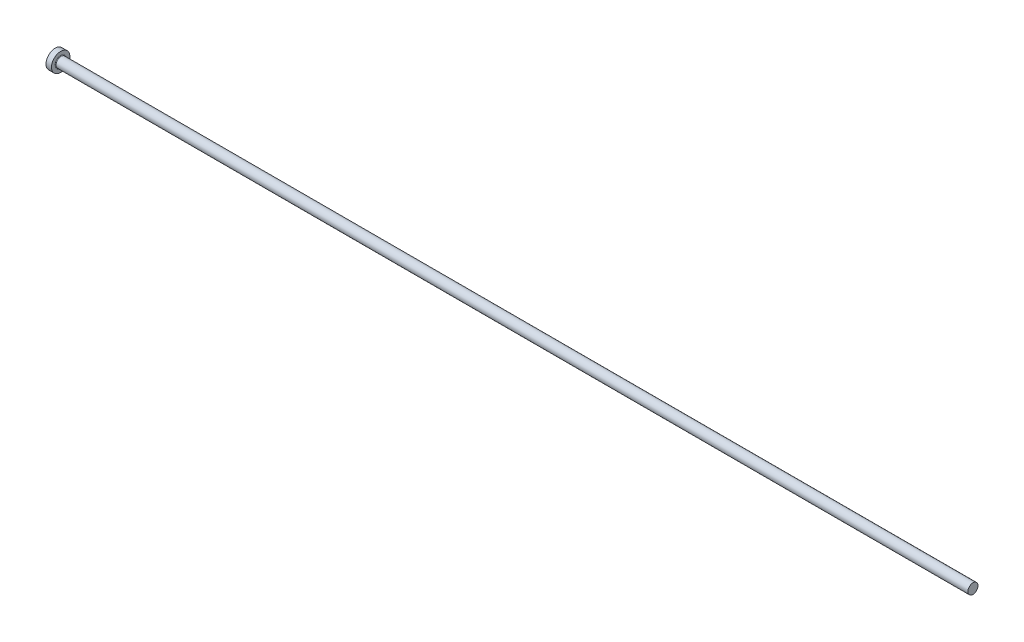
ISO-10303-21;
HEADER;
FILE_DESCRIPTION(('STEP AP214'),'2;1');
FILE_NAME('part.step','',(''),(''),'','','');
FILE_SCHEMA(('AUTOMOTIVE_DESIGN { 1 0 10303 214 1 1 1 1 }'));
ENDSEC;
DATA;
#1=APPLICATION_CONTEXT('core data for automotive mechanical design processes');
#2=APPLICATION_PROTOCOL_DEFINITION('international standard','automotive_design',2000,#1);
#3=PRODUCT_CONTEXT('',#1,'mechanical');
#4=PRODUCT('Part','Part','',(#3));
#5=PRODUCT_RELATED_PRODUCT_CATEGORY('part','',(#4));
#6=PRODUCT_DEFINITION_FORMATION('','',#4);
#7=PRODUCT_DEFINITION_CONTEXT('part definition',#1,'design');
#8=PRODUCT_DEFINITION('design','',#6,#7);
#9=PRODUCT_DEFINITION_SHAPE('','',#8);
#10=(LENGTH_UNIT() NAMED_UNIT(*) SI_UNIT(.MILLI.,.METRE.));
#11=(NAMED_UNIT(*) PLANE_ANGLE_UNIT() SI_UNIT($,.RADIAN.));
#12=(NAMED_UNIT(*) SI_UNIT($,.STERADIAN.) SOLID_ANGLE_UNIT());
#13=UNCERTAINTY_MEASURE_WITH_UNIT(LENGTH_MEASURE(1.E-05),#10,'distance_accuracy_value','');
#14=(GEOMETRIC_REPRESENTATION_CONTEXT(3) GLOBAL_UNCERTAINTY_ASSIGNED_CONTEXT((#13)) GLOBAL_UNIT_ASSIGNED_CONTEXT((#10,
#11,#12)) REPRESENTATION_CONTEXT('',''));
#15=CARTESIAN_POINT('',(0.,0.,0.));
#16=DIRECTION('',(0.,0.,1.));
#17=DIRECTION('',(1.,0.,0.));
#18=AXIS2_PLACEMENT_3D('',#15,#16,#17);
#19=CARTESIAN_POINT('',(0.,0.,0.));
#20=DIRECTION('',(-1.,0.,0.));
#21=DIRECTION('',(0.,-1.,0.));
#22=AXIS2_PLACEMENT_3D('',#19,#20,#21);
#23=PLANE('',#22);
#24=CARTESIAN_POINT('',(0.,0.,0.));
#25=DIRECTION('',(1.,0.,0.));
#26=DIRECTION('',(0.,1.,0.));
#27=AXIS2_PLACEMENT_3D('',#24,#25,#26);
#28=CIRCLE('',#27,5.);
#29=CARTESIAN_POINT('',(0.,5.,0.));
#30=VERTEX_POINT('',#29);
#31=EDGE_CURVE('E25',#30,#30,#28,.T.);
#32=ORIENTED_EDGE('',*,*,#31,.F.);
#33=EDGE_LOOP('',(#32));
#34=FACE_BOUND('',#33,.T.);
#35=ADVANCED_FACE('F14',(#34),#23,.T.);
#36=CARTESIAN_POINT('',(500.,0.,0.));
#37=DIRECTION('',(1.,0.,0.));
#38=DIRECTION('',(0.,1.,0.));
#39=AXIS2_PLACEMENT_3D('',#36,#37,#38);
#40=CYLINDRICAL_SURFACE('',#39,5.);
#41=ORIENTED_EDGE('',*,*,#31,.T.);
#42=EDGE_LOOP('',(#41));
#43=FACE_BOUND('',#42,.T.);
#44=CARTESIAN_POINT('',(3.,0.,0.));
#45=DIRECTION('',(1.,0.,0.));
#46=DIRECTION('',(0.,1.,0.));
#47=AXIS2_PLACEMENT_3D('',#44,#45,#46);
#48=CIRCLE('',#47,5.);
#49=CARTESIAN_POINT('',(3.,5.,0.));
#50=VERTEX_POINT('',#49);
#51=EDGE_CURVE('E29',#50,#50,#48,.T.);
#52=ORIENTED_EDGE('',*,*,#51,.F.);
#53=EDGE_LOOP('',(#52));
#54=FACE_BOUND('',#53,.T.);
#55=ADVANCED_FACE('F51',(#43,#54),#40,.T.);
#56=CARTESIAN_POINT('',(3.,5.,0.));
#57=DIRECTION('',(1.,0.,0.));
#58=DIRECTION('',(0.,1.,0.));
#59=AXIS2_PLACEMENT_3D('',#56,#57,#58);
#60=PLANE('',#59);
#61=CARTESIAN_POINT('',(3.,0.,0.));
#62=DIRECTION('',(1.,0.,0.));
#63=DIRECTION('',(0.,1.,0.));
#64=AXIS2_PLACEMENT_3D('',#61,#62,#63);
#65=CIRCLE('',#64,3.04999999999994);
#66=CARTESIAN_POINT('',(3.,3.04999999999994,0.));
#67=VERTEX_POINT('',#66);
#68=EDGE_CURVE('E9',#67,#67,#65,.F.);
#69=ORIENTED_EDGE('',*,*,#68,.T.);
#70=EDGE_LOOP('',(#69));
#71=FACE_BOUND('',#70,.T.);
#72=ORIENTED_EDGE('',*,*,#51,.T.);
#73=EDGE_LOOP('',(#72));
#74=FACE_BOUND('',#73,.T.);
#75=ADVANCED_FACE('F42',(#71,#74),#60,.T.);
#76=CARTESIAN_POINT('',(500.,0.,0.));
#77=DIRECTION('',(1.,0.,0.));
#78=DIRECTION('',(0.,1.,0.));
#79=AXIS2_PLACEMENT_3D('',#76,#77,#78);
#80=CYLINDRICAL_SURFACE('',#79,2.74999999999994);
#81=CARTESIAN_POINT('',(3.3,0.,0.));
#82=DIRECTION('',(1.,0.,0.));
#83=DIRECTION('',(0.,1.,0.));
#84=AXIS2_PLACEMENT_3D('',#81,#82,#83);
#85=CIRCLE('',#84,2.74999999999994);
#86=CARTESIAN_POINT('',(3.3,2.74999999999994,0.));
#87=VERTEX_POINT('',#86);
#88=EDGE_CURVE('E21',#87,#87,#85,.T.);
#89=ORIENTED_EDGE('',*,*,#88,.T.);
#90=EDGE_LOOP('',(#89));
#91=FACE_BOUND('',#90,.T.);
#92=CARTESIAN_POINT('',(500.,0.,0.));
#93=DIRECTION('',(1.,0.,0.));
#94=DIRECTION('',(0.,1.,0.));
#95=AXIS2_PLACEMENT_3D('',#92,#93,#94);
#96=CIRCLE('',#95,2.74999999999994);
#97=CARTESIAN_POINT('',(500.,2.74999999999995,0.));
#98=VERTEX_POINT('',#97);
#99=EDGE_CURVE('E34',#98,#98,#96,.T.);
#100=ORIENTED_EDGE('',*,*,#99,.F.);
#101=EDGE_LOOP('',(#100));
#102=FACE_BOUND('',#101,.T.);
#103=ADVANCED_FACE('F40',(#91,#102),#80,.T.);
#104=CARTESIAN_POINT('',(500.,2.74999999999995,0.));
#105=DIRECTION('',(1.,0.,0.));
#106=DIRECTION('',(0.,1.,0.));
#107=AXIS2_PLACEMENT_3D('',#104,#105,#106);
#108=PLANE('',#107);
#109=ORIENTED_EDGE('',*,*,#99,.T.);
#110=EDGE_LOOP('',(#109));
#111=FACE_BOUND('',#110,.T.);
#112=ADVANCED_FACE('F38',(#111),#108,.T.);
#113=CARTESIAN_POINT('',(3.3,0.,0.));
#114=DIRECTION('',(1.,0.,0.));
#115=DIRECTION('',(0.,1.,0.));
#116=AXIS2_PLACEMENT_3D('',#113,#114,#115);
#117=TOROIDAL_SURFACE('',#116,3.04999999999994,0.3);
#118=ORIENTED_EDGE('',*,*,#68,.F.);
#119=EDGE_LOOP('',(#118));
#120=FACE_BOUND('',#119,.T.);
#121=ORIENTED_EDGE('',*,*,#88,.F.);
#122=EDGE_LOOP('',(#121));
#123=FACE_BOUND('',#122,.T.);
#124=ADVANCED_FACE('F16',(#120,#123),#117,.F.);
#125=CLOSED_SHELL('',(#35,#55,#75,#103,#112,#124));
#126=MANIFOLD_SOLID_BREP('B1',#125);
#127=ADVANCED_BREP_SHAPE_REPRESENTATION('',(#18,#126),#14);
#128=SHAPE_DEFINITION_REPRESENTATION(#9,#127);
ENDSEC;
END-ISO-10303-21;
